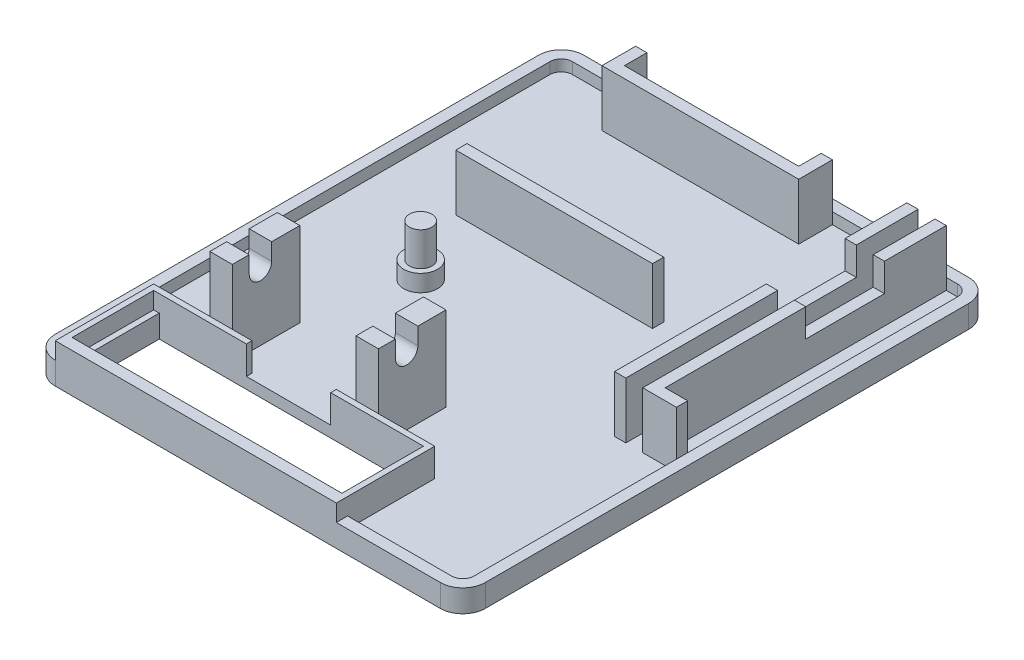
from build123d import *

# Parameters (mm, degrees)
ESQUISSE1_W             = 35
ESQUISSE1_H             = 2
BOSS_EXTRU_1_DEPTH      = 10
BOSS_EXTRU_1_2_DEPTH    = 10
ESQUISSE1_W_2           = 2
ESQUISSE1_H_2           = 52
BOSS_EXTRU_1_3_DEPTH    = 10
BOSS_EXTRU_1_4_DEPTH    = 10
ENL_V_START             = -7
ESQUISSE2_W             = 14
ESQUISSE2_H             = 5
ENL_V_MAT_EXTRU_1_DEPTH = 7
BOSS_EXTRU_2_DEPTH      = 2
BOSS_EXTRU_3_DEPTH      = 2
BOSS_EXTRU_4_DEPTH      = 3
BOSS_EXTRU_4_DEPTH_BACK = 2
ESQUISSE5_W             = 50
ESQUISSE5_H             = 17.5
ESQUISSE5_W_2           = 48
ESQUISSE5_H_2           = 14.5
BOSS_EXTRU_7_DEPTH      = 5
ESQUISSE7_W             = 15
ESQUISSE7_H             = 5
ENL_V_MAT_EXTRU_2_DEPTH = 2
ESQUISSE9_W             = 48
ESQUISSE9_H             = 14.5
ENL_V_MAT_EXTRU_3_DEPTH = 3
ENL_V_MAT_EXTRU_4_REACH = 122.406
ESQUISSE10_W            = 46
ESQUISSE10_H            = 13.5
ESQUISSE11_R            = 3
BOSS_EXTRU_8_DEPTH      = 3
ESQUISSE12_R            = 2
BOSS_EXTRU_9_DEPTH      = 6
ESQUISSE13_W            = 4
ESQUISSE13_H            = 12
BOSS_EXTRU_10_DEPTH     = 15
ENL_V_MAT_EXTRU_5_REACH = 118.068


with BuildPart() as part:
    # Esquisse1 → Boss.-Extru.1 (new body)
    with BuildSketch(Plane.XZ.offset(-8.230124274)):
        with Locations((14.571782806, 43.862448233)):
            Rectangle(ESQUISSE1_W, ESQUISSE1_H)
    extrude(amount=-BOSS_EXTRU_1_DEPTH)



with BuildPart() as body_2:
    # Esquisse1 → Boss.-Extru.1 2 (new body)
    with BuildSketch(Plane.XZ.offset(-8.230124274)):
        Polygon((-0.928217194, 16.862448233), (30.071782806, 16.862448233), (30.071782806, 12.862448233), (32.071782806, 12.862448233), (32.071782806, 16.862448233), (32.071782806, 18.862448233), (-2.928217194, 18.862448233), (-2.928217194, 16.862448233), (-2.928217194, 12.862448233), (-0.928217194, 12.862448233), align=None)
    extrude(amount=-BOSS_EXTRU_1_2_DEPTH)


with BuildPart() as body_3:
    # Esquisse1 → Boss.-Extru.1 3 (new body)
    with BuildSketch(Plane.XZ.offset(-8.230124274)):
        with Locations((46.321782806, 38.862448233)):
            Rectangle(ESQUISSE1_W_2, ESQUISSE1_H_2)
    extrude(amount=-BOSS_EXTRU_1_3_DEPTH)


with BuildPart() as body_4:
    # Esquisse1 → Boss.-Extru.1 4 (new body)
    with BuildSketch(Plane.XZ.offset(-8.230124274)):
        Polygon((50.321782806, 12.862448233), (50.321782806, 64.862448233), (52.321782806, 64.862448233), (56.321782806, 64.862448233), (56.321782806, 62.862448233), (52.321782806, 62.862448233), (52.321782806, 12.862448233), align=None)
    extrude(amount=-BOSS_EXTRU_1_4_DEPTH)


with BuildPart() as enl_v_mat_extru_1_tool:
    # Esquisse2 → Enl_v. mat.-Extru.1 (new body)
    with BuildSketch(Plane(origin=(52.321782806, 0, 0), x_dir=(0, 0, -1), z_dir=(1, 0, 0)).offset(ENL_V_START)):
        with Locations((-30.862448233, 15.730124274)):
            Rectangle(ESQUISSE2_W, ESQUISSE2_H)
    extrude(amount=ENL_V_MAT_EXTRU_1_DEPTH)


with BuildPart() as body_3_1:
    add(body_3.part)

    # Enl_v. mat.-Extru.1: cut by enl_v_mat_extru_1_tool
    add(enl_v_mat_extru_1_tool.part, mode=Mode.SUBTRACT)


with BuildPart() as body_4_1:
    add(body_4.part)

    # Enl_v. mat.-Extru.1: cut by enl_v_mat_extru_1_tool
    add(enl_v_mat_extru_1_tool.part, mode=Mode.SUBTRACT)


with BuildPart() as body_5:
    # Esquisse3 → Boss.-Extru.2 (new body)
    with BuildSketch(Plane.XZ.offset(-8.230124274)):
        with BuildLine():
            Line((54.321782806, 10.862448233), (-14.178217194, 10.862448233))
            ThreePointArc((-14.178217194, 10.862448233), (-17.006644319, 12.034021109), (-18.178217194, 14.862448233))
            Line((-18.178217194, 14.862448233), (-18.178217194, 100.862448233))
            ThreePointArc((-18.178217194, 100.862448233), (-17.006644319, 103.690875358), (-14.178217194, 104.862448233))
            Line((-14.178217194, 104.862448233), (54.321782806, 104.862448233))
            ThreePointArc((54.321782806, 104.862448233), (57.150209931, 103.690875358), (58.321782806, 100.862448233))
            Line((58.321782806, 100.862448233), (58.321782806, 14.862448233))
            ThreePointArc((58.321782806, 14.862448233), (57.150209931, 12.034021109), (54.321782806, 10.862448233))
        make_face()
        with BuildLine():
            Line((54.321782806, 12.862448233), (-14.178217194, 12.862448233))
            ThreePointArc((-14.178217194, 12.862448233), (-15.592430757, 13.448234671), (-16.178217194, 14.862448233))
            Line((-16.178217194, 14.862448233), (-16.178217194, 100.862448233))
            ThreePointArc((-16.178217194, 100.862448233), (-15.592430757, 102.276661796), (-14.178217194, 102.862448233))
            Line((-14.178217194, 102.862448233), (54.321782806, 102.862448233))
            ThreePointArc((54.321782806, 102.862448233), (55.735996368, 102.276661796), (56.321782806, 100.862448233))
            Line((56.321782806, 100.862448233), (56.321782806, 14.862448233))
            ThreePointArc((56.321782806, 14.862448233), (55.735996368, 13.448234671), (54.321782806, 12.862448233))
        make_face(mode=Mode.SUBTRACT)
    extrude(amount=-BOSS_EXTRU_2_DEPTH)


with BuildPart() as part_1:
    add(part.part)

    add(body_2.part)  # Boss.-Extru.3 merges body 2

    add(body_3_1.part)  # Boss.-Extru.3 merges body 3

    add(body_4_1.part)  # Boss.-Extru.3 merges body 4

    add(body_5.part)  # Boss.-Extru.3 merges body 5
    # Esquisse4 → Boss.-Extru.3 (add)
    with BuildSketch(Plane.XZ.offset(-8.230124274)):
        with BuildLine():
            Line((54.321782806, 104.862448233), (-14.178217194, 104.862448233))
            ThreePointArc((-14.178217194, 104.862448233), (-17.006644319, 103.690875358), (-18.178217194, 100.862448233))
            Line((-18.178217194, 100.862448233), (-18.178217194, 14.862448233))
            ThreePointArc((-18.178217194, 14.862448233), (-17.006644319, 12.034021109), (-14.178217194, 10.862448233))
            Line((-14.178217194, 10.862448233), (54.321782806, 10.862448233))
            ThreePointArc((54.321782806, 10.862448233), (57.150209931, 12.034021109), (58.321782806, 14.862448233))
            Line((58.321782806, 14.862448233), (58.321782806, 100.862448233))
            ThreePointArc((58.321782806, 100.862448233), (57.150209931, 103.690875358), (54.321782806, 104.862448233))
        make_face()
    extrude(amount=BOSS_EXTRU_3_DEPTH)

    # Esquisse5 → Boss.-Extru.4 (add, two sides: drawn at the far end of the back side and taken through both)
    with BuildSketch(Plane(origin=(0, 10.230124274, 0), x_dir=(1, 0, 0), z_dir=(0, 1, 0)).offset(-BOSS_EXTRU_4_DEPTH_BACK)):
        with Locations((10.821782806, -96.112448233)):
            Rectangle(ESQUISSE5_W, ESQUISSE5_H)
        with Locations((10.821782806, -95.612448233)):
            Rectangle(ESQUISSE5_W_2, ESQUISSE5_H_2, mode=Mode.SUBTRACT)
    extrude(amount=BOSS_EXTRU_4_DEPTH + BOSS_EXTRU_4_DEPTH_BACK)

    # Esquisse6 → Boss.-Extru.7 (add)
    with BuildSketch(Plane(origin=(0, 8.230124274, 0), x_dir=(1, 0, 0), z_dir=(0, 1, 0))):
        Polygon((33.821782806, -101.862448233), (-12.178217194, -101.862448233), (-12.178217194, -87.362448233), (-13.178217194, -87.362448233), (-13.178217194, -102.862448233), (34.821782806, -102.862448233), (34.821782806, -87.362448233), (33.821782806, -87.362448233), align=None)
    extrude(amount=BOSS_EXTRU_7_DEPTH)

    # Esquisse7 → Enl_v. mat.-Extru.2 (cut)
    with BuildSketch(Plane(origin=(0, 0, 87.362448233), x_dir=(-1, 0, 0), z_dir=(0, 0, -1))):
        with Locations((-10.821782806, 10.730124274)):
            Rectangle(ESQUISSE7_W, ESQUISSE7_H)
    extrude(amount=-ENL_V_MAT_EXTRU_2_DEPTH, mode=Mode.SUBTRACT)

    # Esquisse9 → Enl_v. mat.-Extru.3 (cut)
    with BuildSketch(Plane(origin=(0, 13.230124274, 0), x_dir=(1, 0, 0), z_dir=(0, 1, 0))):
        with Locations((10.821782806, -95.612448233)):
            Rectangle(ESQUISSE9_W, ESQUISSE9_H)
    extrude(amount=-ENL_V_MAT_EXTRU_3_DEPTH, mode=Mode.SUBTRACT)

    # Esquisse10 → Enl_v. mat.-Extru.4 (cut, up to next)
    with BuildSketch(Plane(origin=(0, 8.230124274, 0), x_dir=(1, 0, 0), z_dir=(0, 1, 0)), mode=Mode.PRIVATE) as enl_v_mat_extru_4_sk1:
        with Locations((10.821782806, -95.112448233)):
            Rectangle(ESQUISSE10_W, ESQUISSE10_H)
    enl_v_mat_extru_4_tool1 = extrude(enl_v_mat_extru_4_sk1.sketch, amount=-ENL_V_MAT_EXTRU_4_REACH, mode=Mode.PRIVATE) & part_1.part
    add(enl_v_mat_extru_4_tool1.solids().sort_by_distance((10.821783, 8.230124, 95.112448))[0], mode=Mode.SUBTRACT)

    # Esquisse11 → Boss.-Extru.8 (add)
    with BuildSketch(Plane(origin=(0, 8.230124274, 0), x_dir=(1, 0, 0), z_dir=(0, 1, 0))):
        with Locations(Location((3.821782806, -57.862448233, 0), (0, 0, 90))):
            Circle(ESQUISSE11_R)
    extrude(amount=BOSS_EXTRU_8_DEPTH)

    # Esquisse12 → Boss.-Extru.9 (add)
    with BuildSketch(Plane(origin=(0, 11.230124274, 0), x_dir=(1, 0, 0), z_dir=(0, 1, 0))):
        with Locations(Location((3.821782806, -57.862448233, 0), (0, 0, 270))):
            Circle(ESQUISSE12_R)
    extrude(amount=BOSS_EXTRU_9_DEPTH)

    # Esquisse13 → Boss.-Extru.10 (add)
    with BuildSketch(Plane(origin=(0, 8.230124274, 0), x_dir=(1, 0, 0), z_dir=(0, 1, 0))):
        with Locations((23.821782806, -81.362448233)):
            Rectangle(ESQUISSE13_W, ESQUISSE13_H)
        with Locations((-2.178217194, -81.362448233)):
            Rectangle(ESQUISSE13_W, ESQUISSE13_H)
    extrude(amount=BOSS_EXTRU_10_DEPTH)

    # Enl_v. mat.-Extru.5: up to this face of the body (flat: up to its plane)
    enl_v_mat_extru_5_end = Plane(part_1.part.faces().sort_by_distance((-4.178217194, 15.730124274, 81.362448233))[0])
    # Esquisse14 → Enl_v. mat.-Extru.5 (cut, up to the picked face)
    with BuildSketch(Plane(origin=(25.821782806, 0, 0), x_dir=(0, 0, -1), z_dir=(1, 0, 0)), mode=Mode.PRIVATE) as enl_v_mat_extru_5_sk1:
        with BuildLine():
            Line((-84.362448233, 20.230124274), (-84.362448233, 23.230124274))
            Line((-84.362448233, 23.230124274), (-80.362448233, 23.230124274))
            Line((-80.362448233, 23.230124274), (-80.362448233, 20.230124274))
            ThreePointArc((-80.362448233, 20.230124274), (-82.362448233, 18.230124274), (-84.362448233, 20.230124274))
        make_face()
    enl_v_mat_extru_5_tool1 = split(extrude(enl_v_mat_extru_5_sk1.sketch, amount=-ENL_V_MAT_EXTRU_5_REACH, mode=Mode.PRIVATE), bisect_by=enl_v_mat_extru_5_end, keep=Keep.BOTH, mode=Mode.PRIVATE)
    add(enl_v_mat_extru_5_tool1.solids().sort_by(Axis((25.821783, 20.922928, 82.362448), (-1, 0, 0)))[0], mode=Mode.SUBTRACT)


solid = part_1.part
